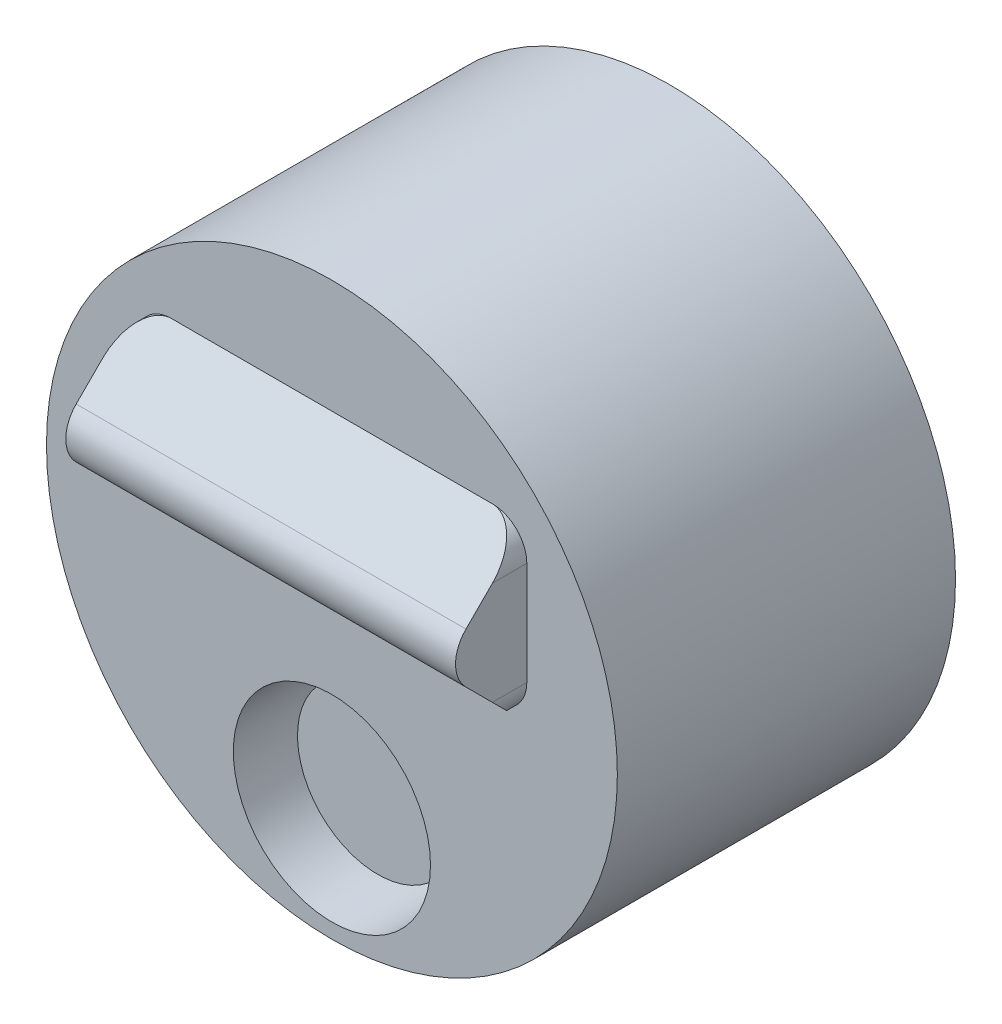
ISO-10303-21;
HEADER;
FILE_DESCRIPTION(('STEP AP214'),'2;1');
FILE_NAME('part.step','',(''),(''),'','','');
FILE_SCHEMA(('AUTOMOTIVE_DESIGN { 1 0 10303 214 1 1 1 1 }'));
ENDSEC;
DATA;
#1=APPLICATION_CONTEXT('core data for automotive mechanical design processes');
#2=APPLICATION_PROTOCOL_DEFINITION('international standard','automotive_design',2000,#1);
#3=PRODUCT_CONTEXT('',#1,'mechanical');
#4=PRODUCT('Part','Part','',(#3));
#5=PRODUCT_RELATED_PRODUCT_CATEGORY('part','',(#4));
#6=PRODUCT_DEFINITION_FORMATION('','',#4);
#7=PRODUCT_DEFINITION_CONTEXT('part definition',#1,'design');
#8=PRODUCT_DEFINITION('design','',#6,#7);
#9=PRODUCT_DEFINITION_SHAPE('','',#8);
#10=(LENGTH_UNIT() NAMED_UNIT(*) SI_UNIT(.MILLI.,.METRE.));
#11=(NAMED_UNIT(*) PLANE_ANGLE_UNIT() SI_UNIT($,.RADIAN.));
#12=(NAMED_UNIT(*) SI_UNIT($,.STERADIAN.) SOLID_ANGLE_UNIT());
#13=UNCERTAINTY_MEASURE_WITH_UNIT(LENGTH_MEASURE(1.E-05),#10,'distance_accuracy_value','');
#14=(GEOMETRIC_REPRESENTATION_CONTEXT(3) GLOBAL_UNCERTAINTY_ASSIGNED_CONTEXT((#13)) GLOBAL_UNIT_ASSIGNED_CONTEXT((#10,
#11,#12)) REPRESENTATION_CONTEXT('',''));
#15=CARTESIAN_POINT('',(0.,0.,0.));
#16=DIRECTION('',(0.,0.,1.));
#17=DIRECTION('',(1.,0.,0.));
#18=AXIS2_PLACEMENT_3D('',#15,#16,#17);
#19=CARTESIAN_POINT('',(0.,0.,0.));
#20=DIRECTION('',(0.,0.,1.));
#21=DIRECTION('',(1.,0.,0.));
#22=AXIS2_PLACEMENT_3D('',#19,#20,#21);
#23=PLANE('',#22);
#24=CARTESIAN_POINT('',(0.,0.,0.));
#25=DIRECTION('',(0.,0.,-1.));
#26=DIRECTION('',(-1.,0.,0.));
#27=AXIS2_PLACEMENT_3D('',#24,#25,#26);
#28=CIRCLE('',#27,6.3246);
#29=CARTESIAN_POINT('',(-6.3246,0.,0.));
#30=VERTEX_POINT('',#29);
#31=EDGE_CURVE('E229',#30,#30,#28,.T.);
#32=ORIENTED_EDGE('',*,*,#31,.F.);
#33=EDGE_LOOP('',(#32));
#34=FACE_BOUND('',#33,.T.);
#35=DIRECTION('',(1.,0.,0.));
#36=VECTOR('',#35,1.);
#37=CARTESIAN_POINT('',(0.,0.,0.));
#38=LINE('',#37,#36);
#39=CARTESIAN_POINT('',(-3.556,0.,0.));
#40=VERTEX_POINT('',#39);
#41=CARTESIAN_POINT('',(3.556,0.,0.));
#42=VERTEX_POINT('',#41);
#43=EDGE_CURVE('E221',#40,#42,#38,.T.);
#44=ORIENTED_EDGE('',*,*,#43,.F.);
#45=CARTESIAN_POINT('',(-3.556,0.762,0.));
#46=DIRECTION('',(0.,0.,1.));
#47=DIRECTION('',(1.,0.,0.));
#48=AXIS2_PLACEMENT_3D('',#45,#46,#47);
#49=CIRCLE('',#48,0.762);
#50=CARTESIAN_POINT('',(-4.318,0.762,0.));
#51=VERTEX_POINT('',#50);
#52=EDGE_CURVE('E223',#40,#51,#49,.F.);
#53=ORIENTED_EDGE('',*,*,#52,.T.);
#54=DIRECTION('',(0.,-1.,0.));
#55=VECTOR('',#54,1.);
#56=CARTESIAN_POINT('',(-4.318,0.,0.));
#57=LINE('',#56,#55);
#58=CARTESIAN_POINT('',(-4.318,3.048,0.));
#59=VERTEX_POINT('',#58);
#60=EDGE_CURVE('E190',#59,#51,#57,.T.);
#61=ORIENTED_EDGE('',*,*,#60,.F.);
#62=CARTESIAN_POINT('',(-3.556,3.048,0.));
#63=DIRECTION('',(0.,0.,1.));
#64=DIRECTION('',(1.,0.,0.));
#65=AXIS2_PLACEMENT_3D('',#62,#63,#64);
#66=CIRCLE('',#65,0.762);
#67=CARTESIAN_POINT('',(-3.556,3.81,0.));
#68=VERTEX_POINT('',#67);
#69=EDGE_CURVE('E208',#59,#68,#66,.F.);
#70=ORIENTED_EDGE('',*,*,#69,.T.);
#71=DIRECTION('',(-1.,0.,0.));
#72=VECTOR('',#71,1.);
#73=CARTESIAN_POINT('',(0.,3.81,0.));
#74=LINE('',#73,#72);
#75=CARTESIAN_POINT('',(3.556,3.81,0.));
#76=VERTEX_POINT('',#75);
#77=EDGE_CURVE('E211',#76,#68,#74,.T.);
#78=ORIENTED_EDGE('',*,*,#77,.F.);
#79=CARTESIAN_POINT('',(3.556,3.048,0.));
#80=DIRECTION('',(0.,0.,1.));
#81=DIRECTION('',(1.,0.,0.));
#82=AXIS2_PLACEMENT_3D('',#79,#80,#81);
#83=CIRCLE('',#82,0.762);
#84=CARTESIAN_POINT('',(4.318,3.048,0.));
#85=VERTEX_POINT('',#84);
#86=EDGE_CURVE('E213',#76,#85,#83,.F.);
#87=ORIENTED_EDGE('',*,*,#86,.T.);
#88=DIRECTION('',(0.,1.,0.));
#89=VECTOR('',#88,1.);
#90=CARTESIAN_POINT('',(4.318,0.,0.));
#91=LINE('',#90,#89);
#92=CARTESIAN_POINT('',(4.318,0.762,0.));
#93=VERTEX_POINT('',#92);
#94=EDGE_CURVE('E216',#93,#85,#91,.T.);
#95=ORIENTED_EDGE('',*,*,#94,.F.);
#96=CARTESIAN_POINT('',(3.556,0.762,0.));
#97=DIRECTION('',(0.,0.,1.));
#98=DIRECTION('',(1.,0.,0.));
#99=AXIS2_PLACEMENT_3D('',#96,#97,#98);
#100=CIRCLE('',#99,0.762);
#101=EDGE_CURVE('E218',#93,#42,#100,.F.);
#102=ORIENTED_EDGE('',*,*,#101,.T.);
#103=EDGE_LOOP('',(#44,#53,#61,#70,#78,#87,#95,#102));
#104=FACE_BOUND('',#103,.T.);
#105=CARTESIAN_POINT('',(0.,-3.81,0.));
#106=DIRECTION('',(0.,0.,1.));
#107=DIRECTION('',(1.,0.,0.));
#108=AXIS2_PLACEMENT_3D('',#105,#106,#107);
#109=CIRCLE('',#108,2.1844);
#110=CARTESIAN_POINT('',(2.1844,-3.81,0.));
#111=VERTEX_POINT('',#110);
#112=EDGE_CURVE('E244',#111,#111,#109,.T.);
#113=ORIENTED_EDGE('',*,*,#112,.F.);
#114=EDGE_LOOP('',(#113));
#115=FACE_BOUND('',#114,.T.);
#116=ADVANCED_FACE('F53',(#34,#104,#115),#23,.T.);
#117=CARTESIAN_POINT('',(0.,-3.81,17.907));
#118=DIRECTION('',(0.,0.,-1.));
#119=DIRECTION('',(-1.,0.,0.));
#120=AXIS2_PLACEMENT_3D('',#117,#118,#119);
#121=CYLINDRICAL_SURFACE('',#120,1.1303);
#122=CARTESIAN_POINT('',(0.,-3.81,-7.493));
#123=DIRECTION('',(0.,0.,1.));
#124=DIRECTION('',(1.,0.,0.));
#125=AXIS2_PLACEMENT_3D('',#122,#123,#124);
#126=CIRCLE('',#125,1.1303);
#127=CARTESIAN_POINT('',(1.1303,-3.81,-7.493));
#128=VERTEX_POINT('',#127);
#129=EDGE_CURVE('E246',#128,#128,#126,.T.);
#130=ORIENTED_EDGE('',*,*,#129,.F.);
#131=EDGE_LOOP('',(#130));
#132=FACE_BOUND('',#131,.T.);
#133=CARTESIAN_POINT('',(0.,-3.81,-3.2004));
#134=DIRECTION('',(0.,0.,-1.));
#135=DIRECTION('',(0.,1.,0.));
#136=AXIS2_PLACEMENT_3D('',#133,#134,#135);
#137=CIRCLE('',#136,1.1303);
#138=CARTESIAN_POINT('',(0.,-2.6797,-3.2004));
#139=VERTEX_POINT('',#138);
#140=EDGE_CURVE('E252',#139,#139,#137,.T.);
#141=ORIENTED_EDGE('',*,*,#140,.F.);
#142=EDGE_LOOP('',(#141));
#143=FACE_BOUND('',#142,.T.);
#144=ADVANCED_FACE('F239',(#132,#143),#121,.F.);
#145=CARTESIAN_POINT('',(0.,0.,-7.493));
#146=DIRECTION('',(0.,0.,-1.));
#147=DIRECTION('',(-1.,0.,0.));
#148=AXIS2_PLACEMENT_3D('',#145,#146,#147);
#149=PLANE('',#148);
#150=DIRECTION('',(-1.,0.,0.));
#151=VECTOR('',#150,1.);
#152=CARTESIAN_POINT('',(3.556,0.,-7.493));
#153=LINE('',#152,#151);
#154=CARTESIAN_POINT('',(-2.85114292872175,0.,-7.493));
#155=VERTEX_POINT('',#154);
#156=CARTESIAN_POINT('',(-3.556,0.,-7.493));
#157=VERTEX_POINT('',#156);
#158=EDGE_CURVE('E182',#155,#157,#153,.T.);
#159=ORIENTED_EDGE('',*,*,#158,.F.);
#160=CARTESIAN_POINT('',(0.,1.905,-7.493));
#161=DIRECTION('',(0.,0.,1.));
#162=DIRECTION('',(1.,0.,0.));
#163=AXIS2_PLACEMENT_3D('',#160,#161,#162);
#164=CIRCLE('',#163,3.429);
#165=CARTESIAN_POINT('',(2.85114292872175,0.,-7.493));
#166=VERTEX_POINT('',#165);
#167=EDGE_CURVE('E151',#155,#166,#164,.T.);
#168=ORIENTED_EDGE('',*,*,#167,.T.);
#169=CARTESIAN_POINT('',(3.556,0.,-7.493));
#170=VERTEX_POINT('',#169);
#171=EDGE_CURVE('E179',#170,#166,#153,.T.);
#172=ORIENTED_EDGE('',*,*,#171,.F.);
#173=CARTESIAN_POINT('',(3.556,0.762,-7.493));
#174=DIRECTION('',(0.,0.,1.));
#175=DIRECTION('',(1.,0.,0.));
#176=AXIS2_PLACEMENT_3D('',#173,#174,#175);
#177=CIRCLE('',#176,0.762);
#178=CARTESIAN_POINT('',(4.318,0.762,-7.493));
#179=VERTEX_POINT('',#178);
#180=EDGE_CURVE('E176',#170,#179,#177,.T.);
#181=ORIENTED_EDGE('',*,*,#180,.T.);
#182=DIRECTION('',(0.,-1.,0.));
#183=VECTOR('',#182,1.);
#184=CARTESIAN_POINT('',(4.318,3.048,-7.493));
#185=LINE('',#184,#183);
#186=CARTESIAN_POINT('',(4.318,3.048,-7.493));
#187=VERTEX_POINT('',#186);
#188=EDGE_CURVE('E169',#187,#179,#185,.T.);
#189=ORIENTED_EDGE('',*,*,#188,.F.);
#190=CARTESIAN_POINT('',(3.556,3.048,-7.493));
#191=DIRECTION('',(0.,0.,1.));
#192=DIRECTION('',(1.,0.,0.));
#193=AXIS2_PLACEMENT_3D('',#190,#191,#192);
#194=CIRCLE('',#193,0.762);
#195=CARTESIAN_POINT('',(3.556,3.81,-7.493));
#196=VERTEX_POINT('',#195);
#197=EDGE_CURVE('E165',#187,#196,#194,.T.);
#198=ORIENTED_EDGE('',*,*,#197,.T.);
#199=DIRECTION('',(1.,0.,0.));
#200=VECTOR('',#199,1.);
#201=CARTESIAN_POINT('',(-3.556,3.81,-7.493));
#202=LINE('',#201,#200);
#203=CARTESIAN_POINT('',(2.85114292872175,3.81,-7.493));
#204=VERTEX_POINT('',#203);
#205=EDGE_CURVE('E156',#204,#196,#202,.T.);
#206=ORIENTED_EDGE('',*,*,#205,.F.);
#207=CARTESIAN_POINT('',(-2.85114292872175,3.81,-7.493));
#208=VERTEX_POINT('',#207);
#209=EDGE_CURVE('E141',#204,#208,#164,.T.);
#210=ORIENTED_EDGE('',*,*,#209,.T.);
#211=CARTESIAN_POINT('',(-3.556,3.81,-7.493));
#212=VERTEX_POINT('',#211);
#213=EDGE_CURVE('E166',#212,#208,#202,.T.);
#214=ORIENTED_EDGE('',*,*,#213,.F.);
#215=CARTESIAN_POINT('',(-3.556,3.048,-7.493));
#216=DIRECTION('',(0.,0.,1.));
#217=DIRECTION('',(1.,0.,0.));
#218=AXIS2_PLACEMENT_3D('',#215,#216,#217);
#219=CIRCLE('',#218,0.762);
#220=CARTESIAN_POINT('',(-4.318,3.048,-7.493));
#221=VERTEX_POINT('',#220);
#222=EDGE_CURVE('E168',#212,#221,#219,.T.);
#223=ORIENTED_EDGE('',*,*,#222,.T.);
#224=DIRECTION('',(0.,1.,0.));
#225=VECTOR('',#224,1.);
#226=CARTESIAN_POINT('',(-4.318,0.762,-7.493));
#227=LINE('',#226,#225);
#228=CARTESIAN_POINT('',(-4.318,0.762,-7.493));
#229=VERTEX_POINT('',#228);
#230=EDGE_CURVE('E206',#229,#221,#227,.T.);
#231=ORIENTED_EDGE('',*,*,#230,.F.);
#232=CARTESIAN_POINT('',(-3.556,0.762,-7.493));
#233=DIRECTION('',(0.,0.,1.));
#234=DIRECTION('',(1.,0.,0.));
#235=AXIS2_PLACEMENT_3D('',#232,#233,#234);
#236=CIRCLE('',#235,0.762);
#237=EDGE_CURVE('E183',#229,#157,#236,.T.);
#238=ORIENTED_EDGE('',*,*,#237,.T.);
#239=EDGE_LOOP('',(#159,#168,#172,#181,#189,#198,#206,#210,#214,#223,#231,#238));
#240=FACE_BOUND('',#239,.T.);
#241=CARTESIAN_POINT('',(0.,0.,-7.493));
#242=DIRECTION('',(0.,0.,1.));
#243=DIRECTION('',(1.,0.,0.));
#244=AXIS2_PLACEMENT_3D('',#241,#242,#243);
#245=CIRCLE('',#244,6.3246);
#246=CARTESIAN_POINT('',(6.3246,0.,-7.493));
#247=VERTEX_POINT('',#246);
#248=EDGE_CURVE('E226',#247,#247,#245,.T.);
#249=ORIENTED_EDGE('',*,*,#248,.F.);
#250=EDGE_LOOP('',(#249));
#251=FACE_BOUND('',#250,.T.);
#252=ORIENTED_EDGE('',*,*,#129,.T.);
#253=EDGE_LOOP('',(#252));
#254=FACE_BOUND('',#253,.T.);
#255=ADVANCED_FACE('F161',(#240,#251,#254),#149,.T.);
#256=CARTESIAN_POINT('',(3.556,0.,17.907));
#257=DIRECTION('',(0.,-1.,0.));
#258=DIRECTION('',(1.,0.,0.));
#259=AXIS2_PLACEMENT_3D('',#256,#257,#258);
#260=PLANE('',#259);
#261=DIRECTION('',(0.,0.,-1.));
#262=VECTOR('',#261,1.);
#263=CARTESIAN_POINT('',(-2.85114292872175,0.,-1.016));
#264=LINE('',#263,#262);
#265=CARTESIAN_POINT('',(-2.85114292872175,0.,-1.016));
#266=VERTEX_POINT('',#265);
#267=EDGE_CURVE('E186',#155,#266,#264,.F.);
#268=ORIENTED_EDGE('',*,*,#267,.F.);
#269=ORIENTED_EDGE('',*,*,#158,.T.);
#270=DIRECTION('',(0.,0.,-1.));
#271=VECTOR('',#270,1.);
#272=CARTESIAN_POINT('',(-3.556,0.,17.907));
#273=LINE('',#272,#271);
#274=EDGE_CURVE('E187',#40,#157,#273,.T.);
#275=ORIENTED_EDGE('',*,*,#274,.F.);
#276=ORIENTED_EDGE('',*,*,#43,.T.);
#277=DIRECTION('',(0.,0.,-1.));
#278=VECTOR('',#277,1.);
#279=CARTESIAN_POINT('',(3.556,0.,17.907));
#280=LINE('',#279,#278);
#281=EDGE_CURVE('E191',#42,#170,#280,.T.);
#282=ORIENTED_EDGE('',*,*,#281,.T.);
#283=ORIENTED_EDGE('',*,*,#171,.T.);
#284=DIRECTION('',(0.,0.,-1.));
#285=VECTOR('',#284,1.);
#286=CARTESIAN_POINT('',(2.85114292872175,0.,-1.016));
#287=LINE('',#286,#285);
#288=CARTESIAN_POINT('',(2.85114292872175,0.,-1.016));
#289=VERTEX_POINT('',#288);
#290=EDGE_CURVE('E260',#289,#166,#287,.T.);
#291=ORIENTED_EDGE('',*,*,#290,.F.);
#292=DIRECTION('',(-1.,0.,0.));
#293=VECTOR('',#292,1.);
#294=CARTESIAN_POINT('',(3.556,0.,-1.016));
#295=LINE('',#294,#293);
#296=EDGE_CURVE('E257',#289,#266,#295,.T.);
#297=ORIENTED_EDGE('',*,*,#296,.T.);
#298=EDGE_LOOP('',(#268,#269,#275,#276,#282,#283,#291,#297));
#299=FACE_BOUND('',#298,.T.);
#300=ADVANCED_FACE('F281',(#299),#260,.F.);
#301=CARTESIAN_POINT('',(-3.556,3.81,17.907));
#302=DIRECTION('',(0.,1.,0.));
#303=DIRECTION('',(0.,0.,1.));
#304=AXIS2_PLACEMENT_3D('',#301,#302,#303);
#305=PLANE('',#304);
#306=DIRECTION('',(0.,0.,-1.));
#307=VECTOR('',#306,1.);
#308=CARTESIAN_POINT('',(2.85114292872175,3.81,-1.016));
#309=LINE('',#308,#307);
#310=CARTESIAN_POINT('',(2.85114292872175,3.81,-1.016));
#311=VERTEX_POINT('',#310);
#312=EDGE_CURVE('E61',#204,#311,#309,.F.);
#313=ORIENTED_EDGE('',*,*,#312,.F.);
#314=ORIENTED_EDGE('',*,*,#205,.T.);
#315=DIRECTION('',(0.,0.,-1.));
#316=VECTOR('',#315,1.);
#317=CARTESIAN_POINT('',(3.556,3.81,17.907));
#318=LINE('',#317,#316);
#319=EDGE_CURVE('E197',#76,#196,#318,.T.);
#320=ORIENTED_EDGE('',*,*,#319,.F.);
#321=ORIENTED_EDGE('',*,*,#77,.T.);
#322=DIRECTION('',(0.,0.,-1.));
#323=VECTOR('',#322,1.);
#324=CARTESIAN_POINT('',(-3.556,3.81,17.907));
#325=LINE('',#324,#323);
#326=EDGE_CURVE('E199',#68,#212,#325,.T.);
#327=ORIENTED_EDGE('',*,*,#326,.T.);
#328=ORIENTED_EDGE('',*,*,#213,.T.);
#329=DIRECTION('',(0.,0.,-1.));
#330=VECTOR('',#329,1.);
#331=CARTESIAN_POINT('',(-2.85114292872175,3.81,-1.016));
#332=LINE('',#331,#330);
#333=CARTESIAN_POINT('',(-2.85114292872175,3.81,-1.016));
#334=VERTEX_POINT('',#333);
#335=EDGE_CURVE('E146',#334,#208,#332,.T.);
#336=ORIENTED_EDGE('',*,*,#335,.F.);
#337=DIRECTION('',(1.,0.,0.));
#338=VECTOR('',#337,1.);
#339=CARTESIAN_POINT('',(-3.556,3.81,-1.016));
#340=LINE('',#339,#338);
#341=EDGE_CURVE('E158',#334,#311,#340,.T.);
#342=ORIENTED_EDGE('',*,*,#341,.T.);
#343=EDGE_LOOP('',(#313,#314,#320,#321,#327,#328,#336,#342));
#344=FACE_BOUND('',#343,.T.);
#345=ADVANCED_FACE('F154',(#344),#305,.F.);
#346=CARTESIAN_POINT('',(0.,0.,-7.493));
#347=DIRECTION('',(0.,0.,1.));
#348=DIRECTION('',(1.,0.,0.));
#349=AXIS2_PLACEMENT_3D('',#346,#347,#348);
#350=CYLINDRICAL_SURFACE('',#349,6.3246);
#351=ORIENTED_EDGE('',*,*,#31,.T.);
#352=EDGE_LOOP('',(#351));
#353=FACE_BOUND('',#352,.T.);
#354=ORIENTED_EDGE('',*,*,#248,.T.);
#355=EDGE_LOOP('',(#354));
#356=FACE_BOUND('',#355,.T.);
#357=ADVANCED_FACE('F55',(#353,#356),#350,.T.);
#358=CARTESIAN_POINT('',(-3.556,0.762,17.907));
#359=DIRECTION('',(0.,0.,-1.));
#360=DIRECTION('',(-1.,0.,0.));
#361=AXIS2_PLACEMENT_3D('',#358,#359,#360);
#362=CYLINDRICAL_SURFACE('',#361,0.762);
#363=ORIENTED_EDGE('',*,*,#274,.T.);
#364=ORIENTED_EDGE('',*,*,#237,.F.);
#365=DIRECTION('',(0.,0.,-1.));
#366=VECTOR('',#365,1.);
#367=CARTESIAN_POINT('',(-4.318,0.762,17.907));
#368=LINE('',#367,#366);
#369=EDGE_CURVE('E203',#51,#229,#368,.T.);
#370=ORIENTED_EDGE('',*,*,#369,.F.);
#371=ORIENTED_EDGE('',*,*,#52,.F.);
#372=EDGE_LOOP('',(#363,#364,#370,#371));
#373=FACE_BOUND('',#372,.T.);
#374=ADVANCED_FACE('F275',(#373),#362,.F.);
#375=CARTESIAN_POINT('',(3.556,0.762,17.907));
#376=DIRECTION('',(0.,0.,-1.));
#377=DIRECTION('',(-1.,0.,0.));
#378=AXIS2_PLACEMENT_3D('',#375,#376,#377);
#379=CYLINDRICAL_SURFACE('',#378,0.762);
#380=DIRECTION('',(0.,0.,-1.));
#381=VECTOR('',#380,1.);
#382=CARTESIAN_POINT('',(4.318,0.762,17.907));
#383=LINE('',#382,#381);
#384=EDGE_CURVE('E193',#93,#179,#383,.T.);
#385=ORIENTED_EDGE('',*,*,#384,.T.);
#386=ORIENTED_EDGE('',*,*,#180,.F.);
#387=ORIENTED_EDGE('',*,*,#281,.F.);
#388=ORIENTED_EDGE('',*,*,#101,.F.);
#389=EDGE_LOOP('',(#385,#386,#387,#388));
#390=FACE_BOUND('',#389,.T.);
#391=ADVANCED_FACE('F288',(#390),#379,.F.);
#392=CARTESIAN_POINT('',(4.318,3.048,17.907));
#393=DIRECTION('',(1.,0.,0.));
#394=DIRECTION('',(0.,0.,-1.));
#395=AXIS2_PLACEMENT_3D('',#392,#393,#394);
#396=PLANE('',#395);
#397=ORIENTED_EDGE('',*,*,#94,.T.);
#398=DIRECTION('',(0.,0.,-1.));
#399=VECTOR('',#398,1.);
#400=CARTESIAN_POINT('',(4.318,3.048,17.907));
#401=LINE('',#400,#399);
#402=EDGE_CURVE('E195',#85,#187,#401,.T.);
#403=ORIENTED_EDGE('',*,*,#402,.T.);
#404=ORIENTED_EDGE('',*,*,#188,.T.);
#405=ORIENTED_EDGE('',*,*,#384,.F.);
#406=EDGE_LOOP('',(#397,#403,#404,#405));
#407=FACE_BOUND('',#406,.T.);
#408=ADVANCED_FACE('F292',(#407),#396,.F.);
#409=CARTESIAN_POINT('',(3.556,3.048,17.907));
#410=DIRECTION('',(0.,0.,-1.));
#411=DIRECTION('',(-1.,0.,0.));
#412=AXIS2_PLACEMENT_3D('',#409,#410,#411);
#413=CYLINDRICAL_SURFACE('',#412,0.762);
#414=ORIENTED_EDGE('',*,*,#319,.T.);
#415=ORIENTED_EDGE('',*,*,#197,.F.);
#416=ORIENTED_EDGE('',*,*,#402,.F.);
#417=ORIENTED_EDGE('',*,*,#86,.F.);
#418=EDGE_LOOP('',(#414,#415,#416,#417));
#419=FACE_BOUND('',#418,.T.);
#420=ADVANCED_FACE('F295',(#419),#413,.F.);
#421=CARTESIAN_POINT('',(-3.556,3.048,17.907));
#422=DIRECTION('',(0.,0.,-1.));
#423=DIRECTION('',(-1.,0.,0.));
#424=AXIS2_PLACEMENT_3D('',#421,#422,#423);
#425=CYLINDRICAL_SURFACE('',#424,0.762);
#426=DIRECTION('',(0.,0.,-1.));
#427=VECTOR('',#426,1.);
#428=CARTESIAN_POINT('',(-4.318,3.048,17.907));
#429=LINE('',#428,#427);
#430=EDGE_CURVE('E201',#59,#221,#429,.T.);
#431=ORIENTED_EDGE('',*,*,#430,.T.);
#432=ORIENTED_EDGE('',*,*,#222,.F.);
#433=ORIENTED_EDGE('',*,*,#326,.F.);
#434=ORIENTED_EDGE('',*,*,#69,.F.);
#435=EDGE_LOOP('',(#431,#432,#433,#434));
#436=FACE_BOUND('',#435,.T.);
#437=ADVANCED_FACE('F269',(#436),#425,.F.);
#438=CARTESIAN_POINT('',(-4.318,0.762,17.907));
#439=DIRECTION('',(-1.,0.,0.));
#440=DIRECTION('',(0.,-1.,0.));
#441=AXIS2_PLACEMENT_3D('',#438,#439,#440);
#442=PLANE('',#441);
#443=ORIENTED_EDGE('',*,*,#60,.T.);
#444=ORIENTED_EDGE('',*,*,#369,.T.);
#445=ORIENTED_EDGE('',*,*,#230,.T.);
#446=ORIENTED_EDGE('',*,*,#430,.F.);
#447=EDGE_LOOP('',(#443,#444,#445,#446));
#448=FACE_BOUND('',#447,.T.);
#449=ADVANCED_FACE('F272',(#448),#442,.F.);
#450=CARTESIAN_POINT('',(0.,1.905,-1.016));
#451=DIRECTION('',(0.,0.,1.));
#452=DIRECTION('',(1.,0.,0.));
#453=AXIS2_PLACEMENT_3D('',#450,#451,#452);
#454=PLANE('',#453);
#455=CARTESIAN_POINT('',(0.,1.905,-1.016));
#456=DIRECTION('',(0.,0.,1.));
#457=DIRECTION('',(1.,0.,0.));
#458=AXIS2_PLACEMENT_3D('',#455,#456,#457);
#459=CIRCLE('',#458,3.429);
#460=EDGE_CURVE('E74',#311,#334,#459,.T.);
#461=ORIENTED_EDGE('',*,*,#460,.F.);
#462=ORIENTED_EDGE('',*,*,#341,.F.);
#463=EDGE_LOOP('',(#461,#462));
#464=FACE_BOUND('',#463,.T.);
#465=ADVANCED_FACE('F330',(#464),#454,.F.);
#466=CARTESIAN_POINT('',(0.,1.905,-1.016));
#467=DIRECTION('',(0.,0.,-1.));
#468=DIRECTION('',(-1.,0.,0.));
#469=AXIS2_PLACEMENT_3D('',#466,#467,#468);
#470=CYLINDRICAL_SURFACE('',#469,3.429);
#471=ORIENTED_EDGE('',*,*,#312,.T.);
#472=ORIENTED_EDGE('',*,*,#460,.T.);
#473=ORIENTED_EDGE('',*,*,#335,.T.);
#474=ORIENTED_EDGE('',*,*,#209,.F.);
#475=EDGE_LOOP('',(#471,#472,#473,#474));
#476=FACE_BOUND('',#475,.T.);
#477=ADVANCED_FACE('F143',(#476),#470,.F.);
#478=ORIENTED_EDGE('',*,*,#267,.T.);
#479=EDGE_CURVE('E67',#266,#289,#459,.T.);
#480=ORIENTED_EDGE('',*,*,#479,.T.);
#481=ORIENTED_EDGE('',*,*,#290,.T.);
#482=ORIENTED_EDGE('',*,*,#167,.F.);
#483=EDGE_LOOP('',(#478,#480,#481,#482));
#484=FACE_BOUND('',#483,.T.);
#485=ADVANCED_FACE('F284',(#484),#470,.F.);
#486=ORIENTED_EDGE('',*,*,#479,.F.);
#487=ORIENTED_EDGE('',*,*,#296,.F.);
#488=EDGE_LOOP('',(#486,#487));
#489=FACE_BOUND('',#488,.T.);
#490=ADVANCED_FACE('F327',(#489),#454,.F.);
#491=CARTESIAN_POINT('',(0.,-3.81,0.));
#492=DIRECTION('',(0.,0.,-1.));
#493=DIRECTION('',(-1.,0.,0.));
#494=AXIS2_PLACEMENT_3D('',#491,#492,#493);
#495=CYLINDRICAL_SURFACE('',#494,2.1844);
#496=ORIENTED_EDGE('',*,*,#112,.T.);
#497=EDGE_LOOP('',(#496));
#498=FACE_BOUND('',#497,.T.);
#499=CARTESIAN_POINT('',(0.,-3.81,-3.2004));
#500=DIRECTION('',(0.,0.,1.));
#501=DIRECTION('',(1.,0.,0.));
#502=AXIS2_PLACEMENT_3D('',#499,#500,#501);
#503=CIRCLE('',#502,2.1844);
#504=CARTESIAN_POINT('',(2.1844,-3.81,-3.2004));
#505=VERTEX_POINT('',#504);
#506=EDGE_CURVE('E247',#505,#505,#503,.T.);
#507=ORIENTED_EDGE('',*,*,#506,.F.);
#508=EDGE_LOOP('',(#507));
#509=FACE_BOUND('',#508,.T.);
#510=ADVANCED_FACE('F325',(#498,#509),#495,.F.);
#511=CARTESIAN_POINT('',(0.,-3.81,-3.2004));
#512=DIRECTION('',(0.,0.,1.));
#513=DIRECTION('',(1.,0.,0.));
#514=AXIS2_PLACEMENT_3D('',#511,#512,#513);
#515=PLANE('',#514);
#516=CARTESIAN_POINT('',(0.,-3.81,-3.2004));
#517=DIRECTION('',(0.,0.,1.));
#518=DIRECTION('',(1.,0.,0.));
#519=AXIS2_PLACEMENT_3D('',#516,#517,#518);
#520=CIRCLE('',#519,1.778);
#521=CARTESIAN_POINT('',(1.778,-3.81,-3.2004));
#522=VERTEX_POINT('',#521);
#523=EDGE_CURVE('E12',#522,#522,#520,.T.);
#524=ORIENTED_EDGE('',*,*,#523,.F.);
#525=EDGE_LOOP('',(#524));
#526=FACE_BOUND('',#525,.T.);
#527=ORIENTED_EDGE('',*,*,#506,.T.);
#528=EDGE_LOOP('',(#527));
#529=FACE_BOUND('',#528,.T.);
#530=ADVANCED_FACE('F359',(#526,#529),#515,.T.);
#531=CARTESIAN_POINT('',(0.,-2.032,-1.016));
#532=DIRECTION('',(0.,0.,1.));
#533=DIRECTION('',(0.,-1.,0.));
#534=AXIS2_PLACEMENT_3D('',#531,#532,#533);
#535=PLANE('',#534);
#536=CARTESIAN_POINT('',(0.,-3.81,-1.016));
#537=DIRECTION('',(0.,0.,-1.));
#538=DIRECTION('',(0.,1.,0.));
#539=AXIS2_PLACEMENT_3D('',#536,#537,#538);
#540=CIRCLE('',#539,1.778);
#541=CARTESIAN_POINT('',(0.,-2.032,-1.016));
#542=VERTEX_POINT('',#541);
#543=EDGE_CURVE('E547',#542,#542,#540,.T.);
#544=ORIENTED_EDGE('',*,*,#543,.F.);
#545=EDGE_LOOP('',(#544));
#546=FACE_BOUND('',#545,.T.);
#547=ADVANCED_FACE('F367',(#546),#535,.T.);
#548=CARTESIAN_POINT('',(0.,-3.81,-10.8101631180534));
#549=DIRECTION('',(0.,0.,-1.));
#550=DIRECTION('',(0.,1.,0.));
#551=AXIS2_PLACEMENT_3D('',#548,#549,#550);
#552=CYLINDRICAL_SURFACE('',#551,1.778);
#553=ORIENTED_EDGE('',*,*,#543,.T.);
#554=EDGE_LOOP('',(#553));
#555=FACE_BOUND('',#554,.T.);
#556=ORIENTED_EDGE('',*,*,#523,.T.);
#557=EDGE_LOOP('',(#556));
#558=FACE_BOUND('',#557,.T.);
#559=ADVANCED_FACE('F374',(#555,#558),#552,.T.);
#560=CARTESIAN_POINT('',(0.,-2.7178,-3.2004));
#561=DIRECTION('',(0.,0.,-1.));
#562=DIRECTION('',(0.,1.,0.));
#563=AXIS2_PLACEMENT_3D('',#560,#561,#562);
#564=PLANE('',#563);
#565=CARTESIAN_POINT('',(0.,-3.81,-3.2004));
#566=DIRECTION('',(0.,0.,-1.));
#567=DIRECTION('',(0.,1.,0.));
#568=AXIS2_PLACEMENT_3D('',#565,#566,#567);
#569=CIRCLE('',#568,1.0922);
#570=CARTESIAN_POINT('',(0.,-2.7178,-3.2004));
#571=VERTEX_POINT('',#570);
#572=EDGE_CURVE('E543',#571,#571,#569,.T.);
#573=ORIENTED_EDGE('',*,*,#572,.F.);
#574=EDGE_LOOP('',(#573));
#575=FACE_BOUND('',#574,.T.);
#576=ORIENTED_EDGE('',*,*,#140,.T.);
#577=EDGE_LOOP('',(#576));
#578=FACE_BOUND('',#577,.T.);
#579=ADVANCED_FACE('F382',(#575,#578),#564,.T.);
#580=CARTESIAN_POINT('',(0.,-3.81,-9.5504));
#581=DIRECTION('',(0.,0.,-1.));
#582=DIRECTION('',(0.,1.,0.));
#583=AXIS2_PLACEMENT_3D('',#580,#581,#582);
#584=PLANE('',#583);
#585=CARTESIAN_POINT('',(0.,-3.81,-9.5504));
#586=DIRECTION('',(0.,0.,-1.));
#587=DIRECTION('',(0.,1.,0.));
#588=AXIS2_PLACEMENT_3D('',#585,#586,#587);
#589=CIRCLE('',#588,1.0922);
#590=CARTESIAN_POINT('',(0.,-2.7178,-9.5504));
#591=VERTEX_POINT('',#590);
#592=EDGE_CURVE('E546',#591,#591,#589,.T.);
#593=ORIENTED_EDGE('',*,*,#592,.T.);
#594=EDGE_LOOP('',(#593));
#595=FACE_BOUND('',#594,.T.);
#596=ADVANCED_FACE('F390',(#595),#584,.T.);
#597=CARTESIAN_POINT('',(0.,-3.81,-10.8101631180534));
#598=DIRECTION('',(0.,0.,-1.));
#599=DIRECTION('',(0.,1.,0.));
#600=AXIS2_PLACEMENT_3D('',#597,#598,#599);
#601=CYLINDRICAL_SURFACE('',#600,1.0922);
#602=ORIENTED_EDGE('',*,*,#572,.T.);
#603=EDGE_LOOP('',(#602));
#604=FACE_BOUND('',#603,.T.);
#605=ORIENTED_EDGE('',*,*,#592,.F.);
#606=EDGE_LOOP('',(#605));
#607=FACE_BOUND('',#606,.T.);
#608=ADVANCED_FACE('F398',(#604,#607),#601,.T.);
#609=CLOSED_SHELL('',(#116,#144,#255,#300,#345,#357,#374,#391,#408,#420,#437,#449,#465,#477,
#485,#490,#510,#530,#547,#559,#579,#596,#608));
#610=MANIFOLD_SOLID_BREP('B2',#609);
#611=CARTESIAN_POINT('',(-3.556,0.762,-1.016));
#612=DIRECTION('',(0.,0.,1.));
#613=DIRECTION('',(1.,0.,0.));
#614=AXIS2_PLACEMENT_3D('',#611,#612,#613);
#615=PLANE('',#614);
#616=DIRECTION('',(1.,0.,0.));
#617=VECTOR('',#616,1.);
#618=CARTESIAN_POINT('',(-3.556,3.81,-1.016));
#619=LINE('',#618,#617);
#620=CARTESIAN_POINT('',(-3.556,3.81,-1.016));
#621=VERTEX_POINT('',#620);
#622=CARTESIAN_POINT('',(-2.85114292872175,3.81,-1.016));
#623=VERTEX_POINT('',#622);
#624=EDGE_CURVE('E679',#621,#623,#619,.T.);
#625=ORIENTED_EDGE('',*,*,#624,.T.);
#626=CARTESIAN_POINT('',(0.,1.905,-1.016));
#627=DIRECTION('',(0.,0.,1.));
#628=DIRECTION('',(1.,0.,0.));
#629=AXIS2_PLACEMENT_3D('',#626,#627,#628);
#630=CIRCLE('',#629,3.429);
#631=CARTESIAN_POINT('',(-2.85114292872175,0.,-1.016));
#632=VERTEX_POINT('',#631);
#633=EDGE_CURVE('E653',#623,#632,#630,.T.);
#634=ORIENTED_EDGE('',*,*,#633,.T.);
#635=DIRECTION('',(-1.,0.,0.));
#636=VECTOR('',#635,1.);
#637=CARTESIAN_POINT('',(3.556,0.,-1.016));
#638=LINE('',#637,#636);
#639=CARTESIAN_POINT('',(-3.556,0.,-1.016));
#640=VERTEX_POINT('',#639);
#641=EDGE_CURVE('E707',#632,#640,#638,.T.);
#642=ORIENTED_EDGE('',*,*,#641,.T.);
#643=CARTESIAN_POINT('',(-3.556,0.762,-1.016));
#644=DIRECTION('',(0.,0.,1.));
#645=DIRECTION('',(1.,0.,0.));
#646=AXIS2_PLACEMENT_3D('',#643,#644,#645);
#647=CIRCLE('',#646,0.762);
#648=CARTESIAN_POINT('',(-4.318,0.762,-1.016));
#649=VERTEX_POINT('',#648);
#650=EDGE_CURVE('E673',#649,#640,#647,.T.);
#651=ORIENTED_EDGE('',*,*,#650,.F.);
#652=DIRECTION('',(0.,1.,0.));
#653=VECTOR('',#652,1.);
#654=CARTESIAN_POINT('',(-4.318,0.762,-1.016));
#655=LINE('',#654,#653);
#656=CARTESIAN_POINT('',(-4.318,3.048,-1.016));
#657=VERTEX_POINT('',#656);
#658=EDGE_CURVE('E687',#649,#657,#655,.T.);
#659=ORIENTED_EDGE('',*,*,#658,.T.);
#660=CARTESIAN_POINT('',(-3.556,3.048,-1.016));
#661=DIRECTION('',(0.,0.,1.));
#662=DIRECTION('',(1.,0.,0.));
#663=AXIS2_PLACEMENT_3D('',#660,#661,#662);
#664=CIRCLE('',#663,0.762);
#665=EDGE_CURVE('E686',#621,#657,#664,.T.);
#666=ORIENTED_EDGE('',*,*,#665,.F.);
#667=EDGE_LOOP('',(#625,#634,#642,#651,#659,#666));
#668=FACE_BOUND('',#667,.T.);
#669=ADVANCED_FACE('F565',(#668),#615,.F.);
#670=CARTESIAN_POINT('',(-3.556,0.762,1.905));
#671=DIRECTION('',(0.,0.,-1.));
#672=DIRECTION('',(-1.,0.,0.));
#673=AXIS2_PLACEMENT_3D('',#670,#671,#672);
#674=CYLINDRICAL_SURFACE('',#673,0.762);
#675=DIRECTION('',(0.,0.,-1.));
#676=VECTOR('',#675,1.);
#677=CARTESIAN_POINT('',(-3.556,0.,1.905));
#678=LINE('',#677,#676);
#679=CARTESIAN_POINT('',(-3.556,0.,0.));
#680=VERTEX_POINT('',#679);
#681=EDGE_CURVE('E710',#680,#640,#678,.T.);
#682=ORIENTED_EDGE('',*,*,#681,.F.);
#683=CARTESIAN_POINT('',(-3.556,0.762,0.762));
#684=DIRECTION('',(0.,0.707106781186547,-0.707106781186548));
#685=DIRECTION('',(0.,-0.707106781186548,-0.707106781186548));
#686=AXIS2_PLACEMENT_3D('',#683,#684,#685);
#687=ELLIPSE('',#686,1.0776307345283,0.762);
#688=CARTESIAN_POINT('',(-4.318,0.762,0.762));
#689=VERTEX_POINT('',#688);
#690=EDGE_CURVE('E728',#680,#689,#687,.T.);
#691=ORIENTED_EDGE('',*,*,#690,.T.);
#692=DIRECTION('',(0.,0.,-1.));
#693=VECTOR('',#692,1.);
#694=CARTESIAN_POINT('',(-4.318,0.762,1.905));
#695=LINE('',#694,#693);
#696=EDGE_CURVE('E724',#689,#649,#695,.T.);
#697=ORIENTED_EDGE('',*,*,#696,.T.);
#698=ORIENTED_EDGE('',*,*,#650,.T.);
#699=EDGE_LOOP('',(#682,#691,#697,#698));
#700=FACE_BOUND('',#699,.T.);
#701=ADVANCED_FACE('F567',(#700),#674,.T.);
#702=CARTESIAN_POINT('',(3.556,0.,1.905));
#703=DIRECTION('',(0.,-1.,0.));
#704=DIRECTION('',(1.,0.,0.));
#705=AXIS2_PLACEMENT_3D('',#702,#703,#704);
#706=PLANE('',#705);
#707=DIRECTION('',(0.,0.,-1.));
#708=VECTOR('',#707,1.);
#709=CARTESIAN_POINT('',(3.556,0.,1.905));
#710=LINE('',#709,#708);
#711=CARTESIAN_POINT('',(3.556,0.,0.));
#712=VERTEX_POINT('',#711);
#713=CARTESIAN_POINT('',(3.556,0.,-1.016));
#714=VERTEX_POINT('',#713);
#715=EDGE_CURVE('E712',#712,#714,#710,.T.);
#716=ORIENTED_EDGE('',*,*,#715,.F.);
#717=DIRECTION('',(-1.,0.,0.));
#718=VECTOR('',#717,1.);
#719=CARTESIAN_POINT('',(3.556,0.,0.));
#720=LINE('',#719,#718);
#721=EDGE_CURVE('E665',#712,#680,#720,.T.);
#722=ORIENTED_EDGE('',*,*,#721,.T.);
#723=ORIENTED_EDGE('',*,*,#681,.T.);
#724=ORIENTED_EDGE('',*,*,#641,.F.);
#725=CARTESIAN_POINT('',(2.85114292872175,0.,-1.016));
#726=VERTEX_POINT('',#725);
#727=EDGE_CURVE('E706',#726,#632,#638,.T.);
#728=ORIENTED_EDGE('',*,*,#727,.F.);
#729=EDGE_CURVE('E703',#714,#726,#638,.T.);
#730=ORIENTED_EDGE('',*,*,#729,.F.);
#731=EDGE_LOOP('',(#716,#722,#723,#724,#728,#730));
#732=FACE_BOUND('',#731,.T.);
#733=ADVANCED_FACE('F769',(#732),#706,.T.);
#734=CARTESIAN_POINT('',(3.556,0.762,1.905));
#735=DIRECTION('',(0.,0.,-1.));
#736=DIRECTION('',(-1.,0.,0.));
#737=AXIS2_PLACEMENT_3D('',#734,#735,#736);
#738=CYLINDRICAL_SURFACE('',#737,0.762);
#739=DIRECTION('',(0.,0.,-1.));
#740=VECTOR('',#739,1.);
#741=CARTESIAN_POINT('',(4.318,0.762,1.905));
#742=LINE('',#741,#740);
#743=CARTESIAN_POINT('',(4.318,0.762,0.762));
#744=VERTEX_POINT('',#743);
#745=CARTESIAN_POINT('',(4.318,0.762,-1.016));
#746=VERTEX_POINT('',#745);
#747=EDGE_CURVE('E714',#744,#746,#742,.T.);
#748=ORIENTED_EDGE('',*,*,#747,.F.);
#749=CARTESIAN_POINT('',(3.556,0.762,0.762));
#750=DIRECTION('',(0.,0.707106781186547,-0.707106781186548));
#751=DIRECTION('',(0.,-0.707106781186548,-0.707106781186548));
#752=AXIS2_PLACEMENT_3D('',#749,#750,#751);
#753=ELLIPSE('',#752,1.0776307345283,0.762);
#754=EDGE_CURVE('E738',#744,#712,#753,.T.);
#755=ORIENTED_EDGE('',*,*,#754,.T.);
#756=ORIENTED_EDGE('',*,*,#715,.T.);
#757=CARTESIAN_POINT('',(3.556,0.762,-1.016));
#758=DIRECTION('',(0.,0.,1.));
#759=DIRECTION('',(1.,0.,0.));
#760=AXIS2_PLACEMENT_3D('',#757,#758,#759);
#761=CIRCLE('',#760,0.762);
#762=EDGE_CURVE('E698',#714,#746,#761,.T.);
#763=ORIENTED_EDGE('',*,*,#762,.T.);
#764=EDGE_LOOP('',(#748,#755,#756,#763));
#765=FACE_BOUND('',#764,.T.);
#766=ADVANCED_FACE('F775',(#765),#738,.T.);
#767=CARTESIAN_POINT('',(4.318,3.048,1.905));
#768=DIRECTION('',(1.,0.,0.));
#769=DIRECTION('',(0.,0.,-1.));
#770=AXIS2_PLACEMENT_3D('',#767,#768,#769);
#771=PLANE('',#770);
#772=DIRECTION('',(0.,0.707106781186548,-0.707106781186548));
#773=VECTOR('',#772,1.);
#774=CARTESIAN_POINT('',(4.318,2.4765,1.3335));
#775=LINE('',#774,#773);
#776=CARTESIAN_POINT('',(4.318,3.048,0.762));
#777=VERTEX_POINT('',#776);
#778=CARTESIAN_POINT('',(4.318,2.46177587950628,1.34822412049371));
#779=VERTEX_POINT('',#778);
#780=EDGE_CURVE('E734',#777,#779,#775,.F.);
#781=ORIENTED_EDGE('',*,*,#780,.T.);
#782=CARTESIAN_POINT('',(4.318,1.905,0.791448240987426));
#783=DIRECTION('',(1.,0.,0.));
#784=DIRECTION('',(0.,0.,-1.));
#785=AXIS2_PLACEMENT_3D('',#782,#783,#784);
#786=CIRCLE('',#785,0.7874);
#787=CARTESIAN_POINT('',(4.318,1.34822412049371,1.34822412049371));
#788=VERTEX_POINT('',#787);
#789=EDGE_CURVE('E51',#779,#788,#786,.T.);
#790=ORIENTED_EDGE('',*,*,#789,.T.);
#791=DIRECTION('',(0.,0.707106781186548,0.707106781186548));
#792=VECTOR('',#791,1.);
#793=CARTESIAN_POINT('',(4.318,2.4765,2.4765));
#794=LINE('',#793,#792);
#795=EDGE_CURVE('E736',#788,#744,#794,.F.);
#796=ORIENTED_EDGE('',*,*,#795,.T.);
#797=ORIENTED_EDGE('',*,*,#747,.T.);
#798=DIRECTION('',(0.,-1.,0.));
#799=VECTOR('',#798,1.);
#800=CARTESIAN_POINT('',(4.318,3.048,-1.016));
#801=LINE('',#800,#799);
#802=CARTESIAN_POINT('',(4.318,3.048,-1.016));
#803=VERTEX_POINT('',#802);
#804=EDGE_CURVE('E694',#803,#746,#801,.T.);
#805=ORIENTED_EDGE('',*,*,#804,.F.);
#806=DIRECTION('',(0.,0.,-1.));
#807=VECTOR('',#806,1.);
#808=CARTESIAN_POINT('',(4.318,3.048,1.905));
#809=LINE('',#808,#807);
#810=EDGE_CURVE('E716',#777,#803,#809,.T.);
#811=ORIENTED_EDGE('',*,*,#810,.F.);
#812=EDGE_LOOP('',(#781,#790,#796,#797,#805,#811));
#813=FACE_BOUND('',#812,.T.);
#814=ADVANCED_FACE('F778',(#813),#771,.T.);
#815=CARTESIAN_POINT('',(3.556,3.048,1.905));
#816=DIRECTION('',(0.,0.,-1.));
#817=DIRECTION('',(-1.,0.,0.));
#818=AXIS2_PLACEMENT_3D('',#815,#816,#817);
#819=CYLINDRICAL_SURFACE('',#818,0.762);
#820=DIRECTION('',(0.,0.,-1.));
#821=VECTOR('',#820,1.);
#822=CARTESIAN_POINT('',(3.556,3.81,1.905));
#823=LINE('',#822,#821);
#824=CARTESIAN_POINT('',(3.556,3.81,0.));
#825=VERTEX_POINT('',#824);
#826=CARTESIAN_POINT('',(3.556,3.81,-1.016));
#827=VERTEX_POINT('',#826);
#828=EDGE_CURVE('E718',#825,#827,#823,.T.);
#829=ORIENTED_EDGE('',*,*,#828,.F.);
#830=CARTESIAN_POINT('',(3.556,3.048,0.762));
#831=DIRECTION('',(0.,-0.707106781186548,-0.707106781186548));
#832=DIRECTION('',(0.,0.707106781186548,-0.707106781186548));
#833=AXIS2_PLACEMENT_3D('',#830,#831,#832);
#834=ELLIPSE('',#833,1.0776307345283,0.762);
#835=EDGE_CURVE('E742',#825,#777,#834,.T.);
#836=ORIENTED_EDGE('',*,*,#835,.T.);
#837=ORIENTED_EDGE('',*,*,#810,.T.);
#838=CARTESIAN_POINT('',(3.556,3.048,-1.016));
#839=DIRECTION('',(0.,0.,1.));
#840=DIRECTION('',(1.,0.,0.));
#841=AXIS2_PLACEMENT_3D('',#838,#839,#840);
#842=CIRCLE('',#841,0.762);
#843=EDGE_CURVE('E690',#803,#827,#842,.T.);
#844=ORIENTED_EDGE('',*,*,#843,.T.);
#845=EDGE_LOOP('',(#829,#836,#837,#844));
#846=FACE_BOUND('',#845,.T.);
#847=ADVANCED_FACE('F810',(#846),#819,.T.);
#848=CARTESIAN_POINT('',(-3.556,3.81,1.905));
#849=DIRECTION('',(0.,1.,0.));
#850=DIRECTION('',(0.,0.,1.));
#851=AXIS2_PLACEMENT_3D('',#848,#849,#850);
#852=PLANE('',#851);
#853=DIRECTION('',(0.,0.,-1.));
#854=VECTOR('',#853,1.);
#855=CARTESIAN_POINT('',(-3.556,3.81,1.905));
#856=LINE('',#855,#854);
#857=CARTESIAN_POINT('',(-3.556,3.81,0.));
#858=VERTEX_POINT('',#857);
#859=EDGE_CURVE('E720',#858,#621,#856,.T.);
#860=ORIENTED_EDGE('',*,*,#859,.F.);
#861=DIRECTION('',(1.,0.,0.));
#862=VECTOR('',#861,1.);
#863=CARTESIAN_POINT('',(-3.556,3.81,0.));
#864=LINE('',#863,#862);
#865=EDGE_CURVE('E740',#858,#825,#864,.T.);
#866=ORIENTED_EDGE('',*,*,#865,.T.);
#867=ORIENTED_EDGE('',*,*,#828,.T.);
#868=CARTESIAN_POINT('',(2.85114292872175,3.81,-1.016));
#869=VERTEX_POINT('',#868);
#870=EDGE_CURVE('E681',#869,#827,#619,.T.);
#871=ORIENTED_EDGE('',*,*,#870,.F.);
#872=EDGE_CURVE('E671',#623,#869,#619,.T.);
#873=ORIENTED_EDGE('',*,*,#872,.F.);
#874=ORIENTED_EDGE('',*,*,#624,.F.);
#875=EDGE_LOOP('',(#860,#866,#867,#871,#873,#874));
#876=FACE_BOUND('',#875,.T.);
#877=ADVANCED_FACE('F678',(#876),#852,.T.);
#878=CARTESIAN_POINT('',(-3.556,3.048,1.905));
#879=DIRECTION('',(0.,0.,-1.));
#880=DIRECTION('',(-1.,0.,0.));
#881=AXIS2_PLACEMENT_3D('',#878,#879,#880);
#882=CYLINDRICAL_SURFACE('',#881,0.762);
#883=DIRECTION('',(0.,0.,-1.));
#884=VECTOR('',#883,1.);
#885=CARTESIAN_POINT('',(-4.318,3.048,1.905));
#886=LINE('',#885,#884);
#887=CARTESIAN_POINT('',(-4.318,3.048,0.762));
#888=VERTEX_POINT('',#887);
#889=EDGE_CURVE('E722',#888,#657,#886,.T.);
#890=ORIENTED_EDGE('',*,*,#889,.F.);
#891=CARTESIAN_POINT('',(-3.556,3.048,0.762));
#892=DIRECTION('',(0.,-0.707106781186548,-0.707106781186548));
#893=DIRECTION('',(0.,0.707106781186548,-0.707106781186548));
#894=AXIS2_PLACEMENT_3D('',#891,#892,#893);
#895=ELLIPSE('',#894,1.0776307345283,0.762);
#896=EDGE_CURVE('E744',#888,#858,#895,.T.);
#897=ORIENTED_EDGE('',*,*,#896,.T.);
#898=ORIENTED_EDGE('',*,*,#859,.T.);
#899=ORIENTED_EDGE('',*,*,#665,.T.);
#900=EDGE_LOOP('',(#890,#897,#898,#899));
#901=FACE_BOUND('',#900,.T.);
#902=ADVANCED_FACE('F801',(#901),#882,.T.);
#903=CARTESIAN_POINT('',(-4.318,0.762,1.905));
#904=DIRECTION('',(-1.,0.,0.));
#905=DIRECTION('',(0.,-1.,0.));
#906=AXIS2_PLACEMENT_3D('',#903,#904,#905);
#907=PLANE('',#906);
#908=DIRECTION('',(0.,-0.707106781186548,-0.707106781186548));
#909=VECTOR('',#908,1.);
#910=CARTESIAN_POINT('',(-4.318,1.3335,1.3335));
#911=LINE('',#910,#909);
#912=CARTESIAN_POINT('',(-4.318,1.34822412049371,1.34822412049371));
#913=VERTEX_POINT('',#912);
#914=EDGE_CURVE('E732',#689,#913,#911,.F.);
#915=ORIENTED_EDGE('',*,*,#914,.T.);
#916=CARTESIAN_POINT('',(-4.318,1.905,0.791448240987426));
#917=DIRECTION('',(-1.,0.,0.));
#918=DIRECTION('',(0.,-1.,0.));
#919=AXIS2_PLACEMENT_3D('',#916,#917,#918);
#920=CIRCLE('',#919,0.7874);
#921=CARTESIAN_POINT('',(-4.318,2.46177587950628,1.34822412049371));
#922=VERTEX_POINT('',#921);
#923=EDGE_CURVE('E587',#913,#922,#920,.T.);
#924=ORIENTED_EDGE('',*,*,#923,.T.);
#925=DIRECTION('',(0.,-0.707106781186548,0.707106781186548));
#926=VECTOR('',#925,1.);
#927=CARTESIAN_POINT('',(-4.318,1.3335,2.4765));
#928=LINE('',#927,#926);
#929=EDGE_CURVE('E730',#922,#888,#928,.F.);
#930=ORIENTED_EDGE('',*,*,#929,.T.);
#931=ORIENTED_EDGE('',*,*,#889,.T.);
#932=ORIENTED_EDGE('',*,*,#658,.F.);
#933=ORIENTED_EDGE('',*,*,#696,.F.);
#934=EDGE_LOOP('',(#915,#924,#930,#931,#932,#933));
#935=FACE_BOUND('',#934,.T.);
#936=ADVANCED_FACE('F758',(#935),#907,.T.);
#937=ORIENTED_EDGE('',*,*,#729,.T.);
#938=EDGE_CURVE('E666',#726,#869,#630,.T.);
#939=ORIENTED_EDGE('',*,*,#938,.T.);
#940=ORIENTED_EDGE('',*,*,#870,.T.);
#941=ORIENTED_EDGE('',*,*,#843,.F.);
#942=ORIENTED_EDGE('',*,*,#804,.T.);
#943=ORIENTED_EDGE('',*,*,#762,.F.);
#944=EDGE_LOOP('',(#937,#939,#940,#941,#942,#943));
#945=FACE_BOUND('',#944,.T.);
#946=ADVANCED_FACE('F771',(#945),#615,.F.);
#947=CARTESIAN_POINT('',(0.,1.905,-1.016));
#948=DIRECTION('',(0.,0.,1.));
#949=DIRECTION('',(1.,0.,0.));
#950=AXIS2_PLACEMENT_3D('',#947,#948,#949);
#951=PLANE('',#950);
#952=EDGE_CURVE('E657',#869,#623,#630,.T.);
#953=ORIENTED_EDGE('',*,*,#952,.T.);
#954=ORIENTED_EDGE('',*,*,#872,.T.);
#955=EDGE_LOOP('',(#953,#954));
#956=FACE_BOUND('',#955,.T.);
#957=ADVANCED_FACE('F670',(#956),#951,.T.);
#958=CARTESIAN_POINT('',(0.,1.905,-1.016));
#959=DIRECTION('',(0.,0.,-1.));
#960=DIRECTION('',(-1.,0.,0.));
#961=AXIS2_PLACEMENT_3D('',#958,#959,#960);
#962=CYLINDRICAL_SURFACE('',#961,3.429);
#963=ORIENTED_EDGE('',*,*,#952,.F.);
#964=ORIENTED_EDGE('',*,*,#938,.F.);
#965=EDGE_CURVE('E660',#632,#726,#630,.T.);
#966=ORIENTED_EDGE('',*,*,#965,.F.);
#967=ORIENTED_EDGE('',*,*,#633,.F.);
#968=EDGE_LOOP('',(#963,#964,#966,#967));
#969=FACE_BOUND('',#968,.T.);
#970=CARTESIAN_POINT('',(0.,1.905,-2.54));
#971=DIRECTION('',(0.,0.,1.));
#972=DIRECTION('',(1.,0.,0.));
#973=AXIS2_PLACEMENT_3D('',#970,#971,#972);
#974=CIRCLE('',#973,3.429);
#975=CARTESIAN_POINT('',(3.429,1.905,-2.54));
#976=VERTEX_POINT('',#975);
#977=EDGE_CURVE('E993',#976,#976,#974,.T.);
#978=ORIENTED_EDGE('',*,*,#977,.T.);
#979=EDGE_LOOP('',(#978));
#980=FACE_BOUND('',#979,.T.);
#981=ADVANCED_FACE('F655',(#969,#980),#962,.T.);
#982=ORIENTED_EDGE('',*,*,#965,.T.);
#983=ORIENTED_EDGE('',*,*,#727,.T.);
#984=EDGE_LOOP('',(#982,#983));
#985=FACE_BOUND('',#984,.T.);
#986=ADVANCED_FACE('F766',(#985),#951,.T.);
#987=CARTESIAN_POINT('',(0.,1.905,-2.54));
#988=DIRECTION('',(0.,0.,1.));
#989=DIRECTION('',(1.,0.,0.));
#990=AXIS2_PLACEMENT_3D('',#987,#988,#989);
#991=PLANE('',#990);
#992=ORIENTED_EDGE('',*,*,#977,.F.);
#993=EDGE_LOOP('',(#992));
#994=FACE_BOUND('',#993,.T.);
#995=ADVANCED_FACE('F955',(#994),#991,.F.);
#996=CARTESIAN_POINT('',(-3.556,3.81,0.));
#997=DIRECTION('',(0.,-0.707106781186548,-0.707106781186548));
#998=DIRECTION('',(0.,0.707106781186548,-0.707106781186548));
#999=AXIS2_PLACEMENT_3D('',#996,#997,#998);
#1000=PLANE('',#999);
#1001=ORIENTED_EDGE('',*,*,#929,.F.);
#1002=DIRECTION('',(1.,0.,0.));
#1003=VECTOR('',#1002,1.);
#1004=CARTESIAN_POINT('',(-3.556,2.46177587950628,1.34822412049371));
#1005=LINE('',#1004,#1003);
#1006=EDGE_CURVE('E573',#922,#779,#1005,.T.);
#1007=ORIENTED_EDGE('',*,*,#1006,.T.);
#1008=ORIENTED_EDGE('',*,*,#780,.F.);
#1009=ORIENTED_EDGE('',*,*,#835,.F.);
#1010=ORIENTED_EDGE('',*,*,#865,.F.);
#1011=ORIENTED_EDGE('',*,*,#896,.F.);
#1012=EDGE_LOOP('',(#1001,#1007,#1008,#1009,#1010,#1011));
#1013=FACE_BOUND('',#1012,.T.);
#1014=ADVANCED_FACE('F786',(#1013),#1000,.F.);
#1015=CARTESIAN_POINT('',(3.556,0.,0.));
#1016=DIRECTION('',(0.,0.707106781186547,-0.707106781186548));
#1017=DIRECTION('',(0.,0.707106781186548,0.707106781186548));
#1018=AXIS2_PLACEMENT_3D('',#1015,#1016,#1017);
#1019=PLANE('',#1018);
#1020=ORIENTED_EDGE('',*,*,#795,.F.);
#1021=DIRECTION('',(1.,0.,0.));
#1022=VECTOR('',#1021,1.);
#1023=CARTESIAN_POINT('',(3.556,1.34822412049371,1.34822412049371));
#1024=LINE('',#1023,#1022);
#1025=EDGE_CURVE('E746',#788,#913,#1024,.F.);
#1026=ORIENTED_EDGE('',*,*,#1025,.T.);
#1027=ORIENTED_EDGE('',*,*,#914,.F.);
#1028=ORIENTED_EDGE('',*,*,#690,.F.);
#1029=ORIENTED_EDGE('',*,*,#721,.F.);
#1030=ORIENTED_EDGE('',*,*,#754,.F.);
#1031=EDGE_LOOP('',(#1020,#1026,#1027,#1028,#1029,#1030));
#1032=FACE_BOUND('',#1031,.T.);
#1033=ADVANCED_FACE('F753',(#1032),#1019,.F.);
#1034=CARTESIAN_POINT('',(3.556,1.905,0.791448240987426));
#1035=DIRECTION('',(-1.,0.,0.));
#1036=DIRECTION('',(0.,0.,1.));
#1037=AXIS2_PLACEMENT_3D('',#1034,#1035,#1036);
#1038=CYLINDRICAL_SURFACE('',#1037,0.7874);
#1039=ORIENTED_EDGE('',*,*,#789,.F.);
#1040=ORIENTED_EDGE('',*,*,#1006,.F.);
#1041=ORIENTED_EDGE('',*,*,#923,.F.);
#1042=ORIENTED_EDGE('',*,*,#1025,.F.);
#1043=EDGE_LOOP('',(#1039,#1040,#1041,#1042));
#1044=FACE_BOUND('',#1043,.T.);
#1045=ADVANCED_FACE('F780',(#1044),#1038,.T.);
#1046=CLOSED_SHELL('',(#669,#701,#733,#766,#814,#847,#877,#902,#936,#946,#957,#981,#986,#995,
#1014,#1033,#1045));
#1047=MANIFOLD_SOLID_BREP('B6',#1046);
#1048=ADVANCED_BREP_SHAPE_REPRESENTATION('',(#18,#610,#1047),#14);
#1049=SHAPE_DEFINITION_REPRESENTATION(#9,#1048);
ENDSEC;
END-ISO-10303-21;
